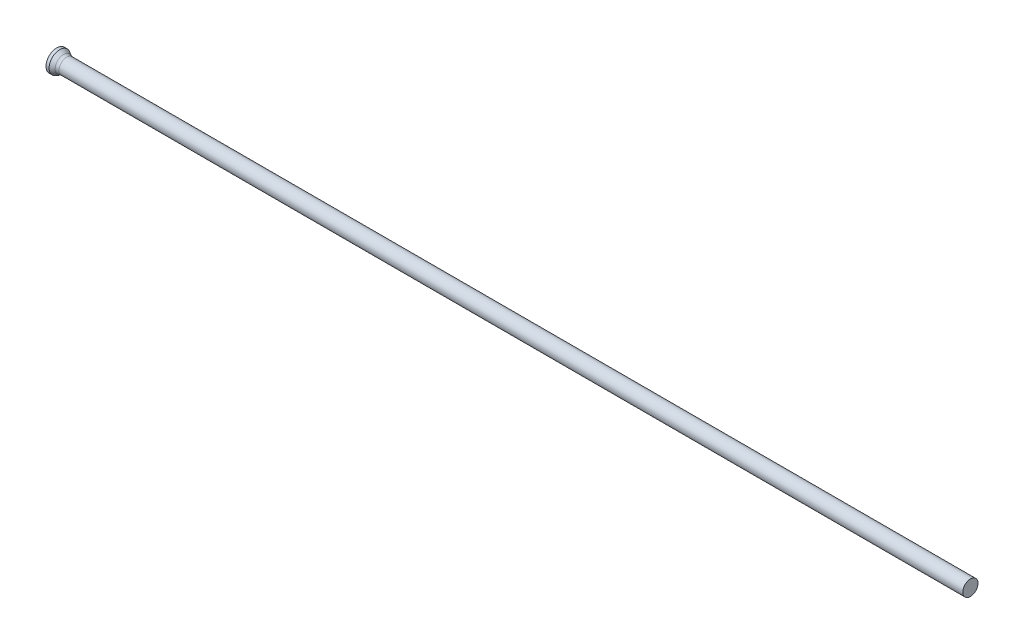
ISO-10303-21;
HEADER;
FILE_DESCRIPTION(('STEP AP214'),'2;1');
FILE_NAME('part.step','',(''),(''),'','','');
FILE_SCHEMA(('AUTOMOTIVE_DESIGN { 1 0 10303 214 1 1 1 1 }'));
ENDSEC;
DATA;
#1=APPLICATION_CONTEXT('core data for automotive mechanical design processes');
#2=APPLICATION_PROTOCOL_DEFINITION('international standard','automotive_design',2000,#1);
#3=PRODUCT_CONTEXT('',#1,'mechanical');
#4=PRODUCT('Part','Part','',(#3));
#5=PRODUCT_RELATED_PRODUCT_CATEGORY('part','',(#4));
#6=PRODUCT_DEFINITION_FORMATION('','',#4);
#7=PRODUCT_DEFINITION_CONTEXT('part definition',#1,'design');
#8=PRODUCT_DEFINITION('design','',#6,#7);
#9=PRODUCT_DEFINITION_SHAPE('','',#8);
#10=(LENGTH_UNIT() NAMED_UNIT(*) SI_UNIT(.MILLI.,.METRE.));
#11=(NAMED_UNIT(*) PLANE_ANGLE_UNIT() SI_UNIT($,.RADIAN.));
#12=(NAMED_UNIT(*) SI_UNIT($,.STERADIAN.) SOLID_ANGLE_UNIT());
#13=UNCERTAINTY_MEASURE_WITH_UNIT(LENGTH_MEASURE(1.E-05),#10,'distance_accuracy_value','');
#14=(GEOMETRIC_REPRESENTATION_CONTEXT(3) GLOBAL_UNCERTAINTY_ASSIGNED_CONTEXT((#13)) GLOBAL_UNIT_ASSIGNED_CONTEXT((#10,
#11,#12)) REPRESENTATION_CONTEXT('',''));
#15=CARTESIAN_POINT('',(0.,0.,0.));
#16=DIRECTION('',(0.,0.,1.));
#17=DIRECTION('',(1.,0.,0.));
#18=AXIS2_PLACEMENT_3D('',#15,#16,#17);
#19=CARTESIAN_POINT('',(0.,0.,0.));
#20=DIRECTION('',(1.,0.,0.));
#21=DIRECTION('',(0.,0.,-1.));
#22=AXIS2_PLACEMENT_3D('',#19,#20,#21);
#23=PLANE('',#22);
#24=CARTESIAN_POINT('',(0.,0.,0.));
#25=DIRECTION('',(-1.,0.,0.));
#26=DIRECTION('',(0.,0.,1.));
#27=AXIS2_PLACEMENT_3D('',#24,#25,#26);
#28=CIRCLE('',#27,1.75);
#29=CARTESIAN_POINT('',(0.,0.,1.75));
#30=VERTEX_POINT('',#29);
#31=EDGE_CURVE('E25',#30,#30,#28,.T.);
#32=ORIENTED_EDGE('',*,*,#31,.T.);
#33=EDGE_LOOP('',(#32));
#34=FACE_BOUND('',#33,.T.);
#35=ADVANCED_FACE('F14',(#34),#23,.F.);
#36=CARTESIAN_POINT('',(0.,0.,0.));
#37=DIRECTION('',(-1.,0.,0.));
#38=DIRECTION('',(0.,0.,1.));
#39=AXIS2_PLACEMENT_3D('',#36,#37,#38);
#40=CYLINDRICAL_SURFACE('',#39,1.75);
#41=ORIENTED_EDGE('',*,*,#31,.F.);
#42=EDGE_LOOP('',(#41));
#43=FACE_BOUND('',#42,.T.);
#44=CARTESIAN_POINT('',(0.503974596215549,0.,0.));
#45=DIRECTION('',(-1.,0.,0.));
#46=DIRECTION('',(0.,0.,1.));
#47=AXIS2_PLACEMENT_3D('',#44,#45,#46);
#48=CIRCLE('',#47,1.75);
#49=CARTESIAN_POINT('',(0.503974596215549,0.,1.75));
#50=VERTEX_POINT('',#49);
#51=EDGE_CURVE('E29',#50,#50,#48,.T.);
#52=ORIENTED_EDGE('',*,*,#51,.T.);
#53=EDGE_LOOP('',(#52));
#54=FACE_BOUND('',#53,.T.);
#55=ADVANCED_FACE('F53',(#43,#54),#40,.T.);
#56=CARTESIAN_POINT('',(1.37,0.,0.));
#57=DIRECTION('',(-1.,0.,0.));
#58=DIRECTION('',(0.,0.,1.));
#59=AXIS2_PLACEMENT_3D('',#56,#57,#58);
#60=CONICAL_SURFACE('',#59,1.25,0.523598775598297);
#61=CARTESIAN_POINT('',(1.13794919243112,0.,0.));
#62=DIRECTION('',(-1.,0.,0.));
#63=DIRECTION('',(0.,0.,1.));
#64=AXIS2_PLACEMENT_3D('',#61,#62,#63);
#65=CIRCLE('',#64,1.38397459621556);
#66=CARTESIAN_POINT('',(1.13794919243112,0.,1.38397459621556));
#67=VERTEX_POINT('',#66);
#68=EDGE_CURVE('E21',#67,#67,#65,.T.);
#69=ORIENTED_EDGE('',*,*,#68,.T.);
#70=EDGE_LOOP('',(#69));
#71=FACE_BOUND('',#70,.T.);
#72=ORIENTED_EDGE('',*,*,#51,.F.);
#73=EDGE_LOOP('',(#72));
#74=FACE_BOUND('',#73,.T.);
#75=ADVANCED_FACE('F50',(#71,#74),#60,.T.);
#76=CARTESIAN_POINT('',(0.,0.,0.));
#77=DIRECTION('',(-1.,0.,0.));
#78=DIRECTION('',(0.,0.,1.));
#79=AXIS2_PLACEMENT_3D('',#76,#77,#78);
#80=CYLINDRICAL_SURFACE('',#79,1.25);
#81=CARTESIAN_POINT('',(1.63794919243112,0.,0.));
#82=DIRECTION('',(-1.,0.,0.));
#83=DIRECTION('',(0.,0.,1.));
#84=AXIS2_PLACEMENT_3D('',#81,#82,#83);
#85=CIRCLE('',#84,1.25);
#86=CARTESIAN_POINT('',(1.63794919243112,0.,1.25));
#87=VERTEX_POINT('',#86);
#88=EDGE_CURVE('E9',#87,#87,#85,.F.);
#89=ORIENTED_EDGE('',*,*,#88,.T.);
#90=EDGE_LOOP('',(#89));
#91=FACE_BOUND('',#90,.T.);
#92=CARTESIAN_POINT('',(150.,0.,0.));
#93=DIRECTION('',(-1.,0.,0.));
#94=DIRECTION('',(0.,0.,1.));
#95=AXIS2_PLACEMENT_3D('',#92,#93,#94);
#96=CIRCLE('',#95,1.25);
#97=CARTESIAN_POINT('',(150.,0.,1.25));
#98=VERTEX_POINT('',#97);
#99=EDGE_CURVE('E34',#98,#98,#96,.T.);
#100=ORIENTED_EDGE('',*,*,#99,.T.);
#101=EDGE_LOOP('',(#100));
#102=FACE_BOUND('',#101,.T.);
#103=ADVANCED_FACE('F38',(#91,#102),#80,.T.);
#104=CARTESIAN_POINT('',(150.,1.25,0.));
#105=DIRECTION('',(-1.,0.,0.));
#106=DIRECTION('',(0.,0.,1.));
#107=AXIS2_PLACEMENT_3D('',#104,#105,#106);
#108=PLANE('',#107);
#109=ORIENTED_EDGE('',*,*,#99,.F.);
#110=EDGE_LOOP('',(#109));
#111=FACE_BOUND('',#110,.T.);
#112=ADVANCED_FACE('F40',(#111),#108,.F.);
#113=CARTESIAN_POINT('',(1.63794919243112,0.,0.));
#114=DIRECTION('',(-1.,0.,0.));
#115=DIRECTION('',(0.,0.,1.));
#116=AXIS2_PLACEMENT_3D('',#113,#114,#115);
#117=TOROIDAL_SURFACE('',#116,2.25,1.);
#118=ORIENTED_EDGE('',*,*,#88,.F.);
#119=EDGE_LOOP('',(#118));
#120=FACE_BOUND('',#119,.T.);
#121=ORIENTED_EDGE('',*,*,#68,.F.);
#122=EDGE_LOOP('',(#121));
#123=FACE_BOUND('',#122,.T.);
#124=ADVANCED_FACE('F16',(#120,#123),#117,.F.);
#125=CLOSED_SHELL('',(#35,#55,#75,#103,#112,#124));
#126=MANIFOLD_SOLID_BREP('B1',#125);
#127=ADVANCED_BREP_SHAPE_REPRESENTATION('',(#18,#126),#14);
#128=SHAPE_DEFINITION_REPRESENTATION(#9,#127);
ENDSEC;
END-ISO-10303-21;
